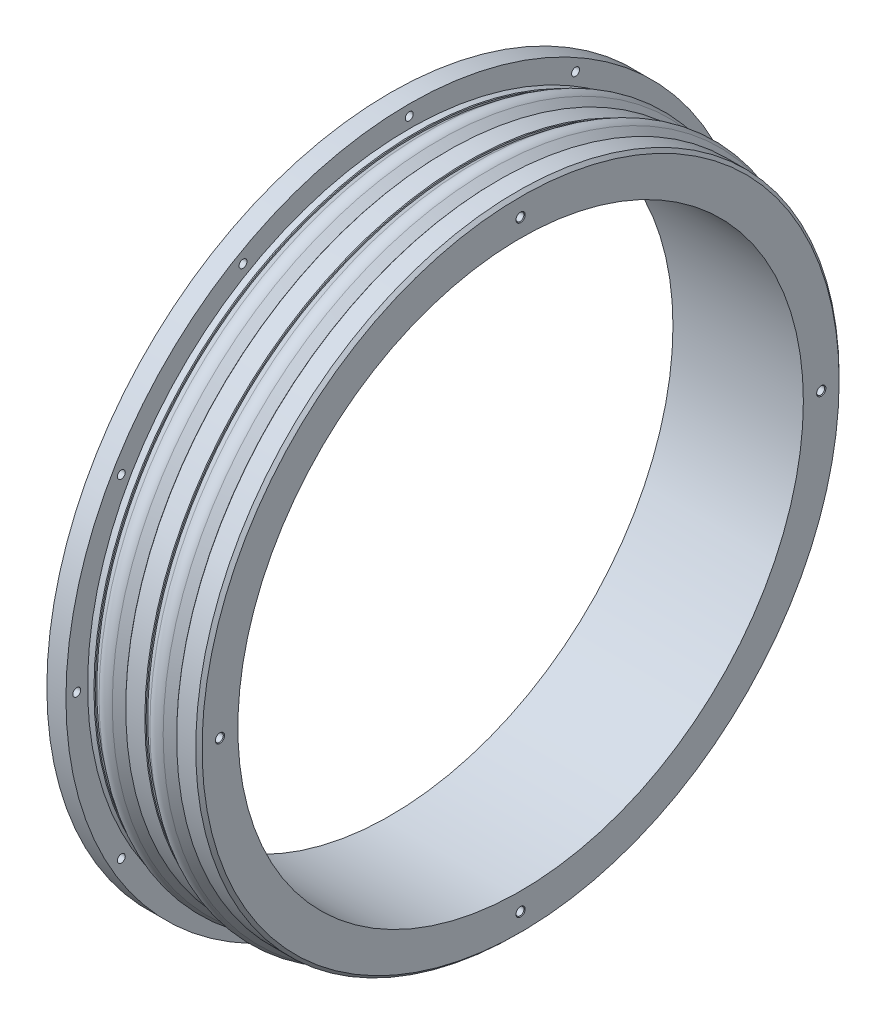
from build123d import *

# Parameters (mm, degrees)
CHAMFER1_SIZE                   = 1
CHAMFER2_SIZE                   = 0.2
TAP_DRILL_FOR_M3X0_5_TAP2_D     = 2.5
TAP_DRILL_FOR_M3X0_5_TAP3_D     = 2.5
TAP_DRILL_FOR_M3X0_5_TAP3_DEPTH = 4
TAP_DRILL_FOR_M3X0_5_TAP3_TIP   = 0.751075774
CHAMFER3_SIZE                   = 0.2
CHAMFER4_SIZE                   = 0.2


with BuildPart() as part:
    # Sketch2 → Revolve1 (revolve)
    with BuildSketch(Plane(origin=(0, 0, 0), x_dir=(1, 0, 0), z_dir=(0, 1, 0))):
        with BuildLine():
            Line((0, 88.9), (41, 88.9))
            Line((41, 88.9), (41, 101.15))
            Line((41, 101.15), (33.8, 101.15))
            Line((33.8, 101.15), (33.8, 100.45))
            Line((33.8, 100.45), (31.083348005, 102.46241197))
            ThreePointArc((31.083348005, 102.46241197), (29, 103.15), (26.916651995, 102.46241197))
            Line((26.916651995, 102.46241197), (24.2, 100.45))
            Line((24.2, 100.45), (24.2, 101.15))
            Line((24.2, 101.15), (17.8, 101.15))
            Line((17.8, 101.15), (17.8, 100.45))
            Line((17.8, 100.45), (15.083348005, 102.46241197))
            ThreePointArc((15.083348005, 102.46241197), (13, 103.15), (10.916651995, 102.46241197))
            Line((10.916651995, 102.46241197), (8.2, 100.45))
            Line((8.2, 100.45), (8.2, 101.15))
            Line((8.2, 101.15), (6, 101.15))
            Line((6, 101.15), (6, 107.95))
            Line((6, 107.95), (0, 107.95))
            Line((0, 107.95), (0, 101.27))
            Line((0, 101.27), (0.75, 101.27))
            Line((0.75, 101.27), (0.011318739, 100.728889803))
            ThreePointArc((0.011318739, 100.728889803), (-0.5, 99.7205), (0.011318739, 98.712110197))
            Line((0.011318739, 98.712110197), (0.75, 98.171))
            Line((0.75, 98.171), (0, 98.171))
            Line((0, 98.171), (0, 88.9))
        make_face()
    revolve(axis=Axis((0, 0, 0), (-1, 0, 0)))

    # Chamfer1
    chamfer1_edges = [part.edges().sort_by_distance(p)[0] for p in [
        (41, 0, 101.15),
    ]]
    chamfer(chamfer1_edges, length=CHAMFER1_SIZE)

    # Chamfer2
    chamfer2_edges = [part.edges().sort_by_distance(p)[0] for p in [
        (33.8, 0, 101.15),
        (0, 0, 98.171),
        (0, 0, 101.27),
        (8.2, 0, 101.15),
        (17.8, 0, 101.15),
        (24.2, 0, 101.15),
    ]]
    chamfer(chamfer2_edges, length=CHAMFER2_SIZE)

    # Tap Drill for M3x0.5 Tap2 (through all)
    with Locations(Plane(origin=(6, 104.55, 0), x_dir=(0, 0, 1), z_dir=(1, 0, 0))):
        with Locations((0, 0), (-52.275, 14.007044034), (-90.542955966, 52.275), (-104.55, 104.55), (-90.542955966, 156.825), (-52.275, 195.092955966), (0, 209.1), (52.275, 195.092955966), (90.542955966, 156.825), (104.55, 104.55), (90.542955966, 52.275), (52.275, 14.007044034)):
            Hole(TAP_DRILL_FOR_M3X0_5_TAP2_D / 2)

    # Tap Drill for M3x0.5 Tap3
    with Locations(Plane(origin=(41, 94.525, 0), x_dir=(0, 0, 1), z_dir=(1, 0, 0))):
        with Locations((0, 0), (-94.525, 94.525), (0, 189.05), (94.525, 94.525)):
            Hole(TAP_DRILL_FOR_M3X0_5_TAP3_D / 2, depth=TAP_DRILL_FOR_M3X0_5_TAP3_DEPTH)
            with Locations((0, 0, -(TAP_DRILL_FOR_M3X0_5_TAP3_DEPTH + TAP_DRILL_FOR_M3X0_5_TAP3_TIP / 2))):  # 118° drill point
                Cone(0, TAP_DRILL_FOR_M3X0_5_TAP3_D / 2, TAP_DRILL_FOR_M3X0_5_TAP3_TIP, mode=Mode.SUBTRACT)

    # Chamfer3
    chamfer3_edges = [part.edges().sort_by_distance(p)[0] for p in [
        (41, 0, 95.775),
        (41, -94.525, 1.25),
        (41, 0, -93.275),
        (41, 94.525, 1.25),
    ]]
    chamfer(chamfer3_edges, length=CHAMFER3_SIZE)

    # Chamfer4
    chamfer4_edges = [part.edges().sort_by_distance(p)[0] for p in [
        (0, 52.275, 91.792955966),
        (0, 0, 105.8),
        (0, -52.275, 91.792955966),
        (0, -90.542955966, 53.525),
        (0, -104.55, 1.25),
        (0, -90.542955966, -51.025),
        (0, -52.275, -89.292955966),
        (0, 0, -103.3),
        (0, 52.275, -89.292955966),
        (0, 90.542955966, -51.025),
        (0, 104.55, 1.25),
        (0, 90.542955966, 53.525),
    ]]
    chamfer(chamfer4_edges, length=CHAMFER4_SIZE)


solid = part.part
